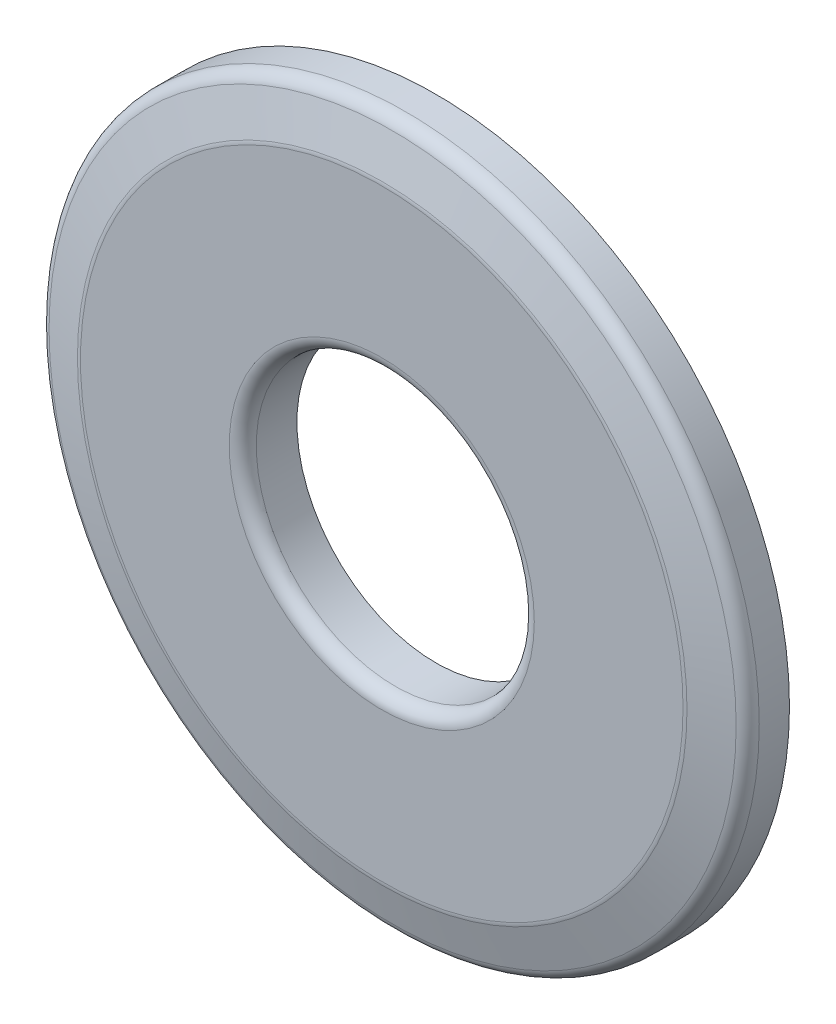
ISO-10303-21;
HEADER;
FILE_DESCRIPTION(('STEP AP214'),'2;1');
FILE_NAME('part.step','',(''),(''),'','','');
FILE_SCHEMA(('AUTOMOTIVE_DESIGN { 1 0 10303 214 1 1 1 1 }'));
ENDSEC;
DATA;
#1=APPLICATION_CONTEXT('core data for automotive mechanical design processes');
#2=APPLICATION_PROTOCOL_DEFINITION('international standard','automotive_design',2000,#1);
#3=PRODUCT_CONTEXT('',#1,'mechanical');
#4=PRODUCT('Part','Part','',(#3));
#5=PRODUCT_RELATED_PRODUCT_CATEGORY('part','',(#4));
#6=PRODUCT_DEFINITION_FORMATION('','',#4);
#7=PRODUCT_DEFINITION_CONTEXT('part definition',#1,'design');
#8=PRODUCT_DEFINITION('design','',#6,#7);
#9=PRODUCT_DEFINITION_SHAPE('','',#8);
#10=(LENGTH_UNIT() NAMED_UNIT(*) SI_UNIT(.MILLI.,.METRE.));
#11=(NAMED_UNIT(*) PLANE_ANGLE_UNIT() SI_UNIT($,.RADIAN.));
#12=(NAMED_UNIT(*) SI_UNIT($,.STERADIAN.) SOLID_ANGLE_UNIT());
#13=UNCERTAINTY_MEASURE_WITH_UNIT(LENGTH_MEASURE(1.E-05),#10,'distance_accuracy_value','');
#14=(GEOMETRIC_REPRESENTATION_CONTEXT(3) GLOBAL_UNCERTAINTY_ASSIGNED_CONTEXT((#13)) GLOBAL_UNIT_ASSIGNED_CONTEXT((#10,
#11,#12)) REPRESENTATION_CONTEXT('',''));
#15=CARTESIAN_POINT('',(0.,0.,0.));
#16=DIRECTION('',(0.,0.,1.));
#17=DIRECTION('',(1.,0.,0.));
#18=AXIS2_PLACEMENT_3D('',#15,#16,#17);
#19=CARTESIAN_POINT('',(0.,0.,1.7018));
#20=DIRECTION('',(0.,0.,1.));
#21=DIRECTION('',(1.,0.,0.));
#22=AXIS2_PLACEMENT_3D('',#19,#20,#21);
#23=PLANE('',#22);
#24=CARTESIAN_POINT('',(0.,0.,1.7018));
#25=DIRECTION('',(0.,0.,1.));
#26=DIRECTION('',(1.,0.,0.));
#27=AXIS2_PLACEMENT_3D('',#24,#25,#26);
#28=CIRCLE('',#27,18.9373748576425);
#29=CARTESIAN_POINT('',(18.9373748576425,0.,1.7018));
#30=VERTEX_POINT('',#29);
#31=EDGE_CURVE('E53',#30,#30,#28,.T.);
#32=ORIENTED_EDGE('',*,*,#31,.T.);
#33=EDGE_LOOP('',(#32));
#34=FACE_BOUND('',#33,.T.);
#35=CARTESIAN_POINT('',(0.,0.,1.7018));
#36=DIRECTION('',(0.,0.,1.));
#37=DIRECTION('',(1.,0.,0.));
#38=AXIS2_PLACEMENT_3D('',#35,#36,#37);
#39=CIRCLE('',#38,9.5885);
#40=CARTESIAN_POINT('',(9.5885,0.,1.7018));
#41=VERTEX_POINT('',#40);
#42=EDGE_CURVE('E56',#41,#41,#39,.F.);
#43=ORIENTED_EDGE('',*,*,#42,.T.);
#44=EDGE_LOOP('',(#43));
#45=FACE_BOUND('',#44,.T.);
#46=ADVANCED_FACE('F33',(#34,#45),#23,.T.);
#47=CARTESIAN_POINT('',(0.,0.,1.7018));
#48=DIRECTION('',(0.,0.,-1.));
#49=DIRECTION('',(-1.,0.,0.));
#50=AXIS2_PLACEMENT_3D('',#47,#48,#49);
#51=CYLINDRICAL_SURFACE('',#50,22.225);
#52=CARTESIAN_POINT('',(0.,0.,0.197981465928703));
#53=DIRECTION('',(0.,0.,1.));
#54=DIRECTION('',(1.,0.,0.));
#55=AXIS2_PLACEMENT_3D('',#52,#53,#54);
#56=CIRCLE('',#55,22.225);
#57=CARTESIAN_POINT('',(22.225,0.,0.197981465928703));
#58=VERTEX_POINT('',#57);
#59=EDGE_CURVE('E40',#58,#58,#56,.F.);
#60=ORIENTED_EDGE('',*,*,#59,.T.);
#61=EDGE_LOOP('',(#60));
#62=FACE_BOUND('',#61,.T.);
#63=CARTESIAN_POINT('',(0.,0.,-1.7018));
#64=DIRECTION('',(0.,0.,1.));
#65=DIRECTION('',(1.,0.,0.));
#66=AXIS2_PLACEMENT_3D('',#63,#64,#65);
#67=CIRCLE('',#66,22.225);
#68=CARTESIAN_POINT('',(22.225,0.,-1.7018));
#69=VERTEX_POINT('',#68);
#70=EDGE_CURVE('E59',#69,#69,#67,.T.);
#71=ORIENTED_EDGE('',*,*,#70,.T.);
#72=EDGE_LOOP('',(#71));
#73=FACE_BOUND('',#72,.T.);
#74=ADVANCED_FACE('F71',(#62,#73),#51,.T.);
#75=CARTESIAN_POINT('',(0.,0.,1.7018));
#76=DIRECTION('',(0.,0.,-1.));
#77=DIRECTION('',(-1.,0.,0.));
#78=AXIS2_PLACEMENT_3D('',#75,#76,#77);
#79=CYLINDRICAL_SURFACE('',#78,8.7376);
#80=CARTESIAN_POINT('',(0.,0.,0.850899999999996));
#81=DIRECTION('',(0.,0.,1.));
#82=DIRECTION('',(1.,0.,0.));
#83=AXIS2_PLACEMENT_3D('',#80,#81,#82);
#84=CIRCLE('',#83,8.7376);
#85=CARTESIAN_POINT('',(8.7376,0.,0.850899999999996));
#86=VERTEX_POINT('',#85);
#87=EDGE_CURVE('E10',#86,#86,#84,.T.);
#88=ORIENTED_EDGE('',*,*,#87,.T.);
#89=EDGE_LOOP('',(#88));
#90=FACE_BOUND('',#89,.T.);
#91=CARTESIAN_POINT('',(0.,0.,-1.7018));
#92=DIRECTION('',(0.,0.,1.));
#93=DIRECTION('',(1.,0.,0.));
#94=AXIS2_PLACEMENT_3D('',#91,#92,#93);
#95=CIRCLE('',#94,8.7376);
#96=CARTESIAN_POINT('',(8.7376,0.,-1.7018));
#97=VERTEX_POINT('',#96);
#98=EDGE_CURVE('E62',#97,#97,#95,.T.);
#99=ORIENTED_EDGE('',*,*,#98,.F.);
#100=EDGE_LOOP('',(#99));
#101=FACE_BOUND('',#100,.T.);
#102=ADVANCED_FACE('F69',(#90,#101),#79,.F.);
#103=CARTESIAN_POINT('',(0.,0.,-1.7018));
#104=DIRECTION('',(0.,0.,1.));
#105=DIRECTION('',(1.,0.,0.));
#106=AXIS2_PLACEMENT_3D('',#103,#104,#105);
#107=PLANE('',#106);
#108=ORIENTED_EDGE('',*,*,#98,.T.);
#109=EDGE_LOOP('',(#108));
#110=FACE_BOUND('',#109,.T.);
#111=ORIENTED_EDGE('',*,*,#70,.F.);
#112=EDGE_LOOP('',(#111));
#113=FACE_BOUND('',#112,.T.);
#114=ADVANCED_FACE('F66',(#110,#113),#107,.F.);
#115=CARTESIAN_POINT('',(0.,0.,1.7018));
#116=DIRECTION('',(0.,0.,-1.));
#117=DIRECTION('',(-1.,0.,0.));
#118=AXIS2_PLACEMENT_3D('',#115,#116,#117);
#119=CONICAL_SURFACE('',#118,19.0493979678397,1.30899693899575);
#120=CARTESIAN_POINT('',(0.,0.,1.67280628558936));
#121=DIRECTION('',(0.,0.,1.));
#122=DIRECTION('',(1.,0.,0.));
#123=AXIS2_PLACEMENT_3D('',#120,#121,#122);
#124=CIRCLE('',#123,19.1576039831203);
#125=CARTESIAN_POINT('',(19.1576039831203,0.,1.67280628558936));
#126=VERTEX_POINT('',#125);
#127=EDGE_CURVE('E44',#126,#126,#124,.F.);
#128=ORIENTED_EDGE('',*,*,#127,.T.);
#129=EDGE_LOOP('',(#128));
#130=FACE_BOUND('',#129,.T.);
#131=CARTESIAN_POINT('',(0.,0.,1.01988775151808));
#132=DIRECTION('',(0.,0.,-1.));
#133=DIRECTION('',(-1.,0.,0.));
#134=AXIS2_PLACEMENT_3D('',#131,#132,#133);
#135=CIRCLE('',#134,21.5943291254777);
#136=CARTESIAN_POINT('',(-21.5943291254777,0.,1.01988775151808));
#137=VERTEX_POINT('',#136);
#138=EDGE_CURVE('E48',#137,#137,#135,.F.);
#139=ORIENTED_EDGE('',*,*,#138,.T.);
#140=EDGE_LOOP('',(#139));
#141=FACE_BOUND('',#140,.T.);
#142=ADVANCED_FACE('F77',(#130,#141),#119,.T.);
#143=CARTESIAN_POINT('',(0.,0.,0.850899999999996));
#144=DIRECTION('',(0.,0.,1.));
#145=DIRECTION('',(1.,0.,0.));
#146=AXIS2_PLACEMENT_3D('',#143,#144,#145);
#147=TOROIDAL_SURFACE('',#146,18.9373748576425,0.8509);
#148=ORIENTED_EDGE('',*,*,#127,.F.);
#149=EDGE_LOOP('',(#148));
#150=FACE_BOUND('',#149,.T.);
#151=ORIENTED_EDGE('',*,*,#31,.F.);
#152=EDGE_LOOP('',(#151));
#153=FACE_BOUND('',#152,.T.);
#154=ADVANCED_FACE('F89',(#150,#153),#147,.T.);
#155=CARTESIAN_POINT('',(0.,0.,0.197981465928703));
#156=DIRECTION('',(0.,0.,1.));
#157=DIRECTION('',(1.,0.,0.));
#158=AXIS2_PLACEMENT_3D('',#155,#156,#157);
#159=TOROIDAL_SURFACE('',#158,21.3741,0.8509);
#160=ORIENTED_EDGE('',*,*,#138,.F.);
#161=EDGE_LOOP('',(#160));
#162=FACE_BOUND('',#161,.T.);
#163=ORIENTED_EDGE('',*,*,#59,.F.);
#164=EDGE_LOOP('',(#163));
#165=FACE_BOUND('',#164,.T.);
#166=ADVANCED_FACE('F92',(#162,#165),#159,.T.);
#167=CARTESIAN_POINT('',(0.,0.,0.850899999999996));
#168=DIRECTION('',(0.,0.,1.));
#169=DIRECTION('',(1.,0.,0.));
#170=AXIS2_PLACEMENT_3D('',#167,#168,#169);
#171=TOROIDAL_SURFACE('',#170,9.5885,0.8509);
#172=ORIENTED_EDGE('',*,*,#42,.F.);
#173=EDGE_LOOP('',(#172));
#174=FACE_BOUND('',#173,.T.);
#175=ORIENTED_EDGE('',*,*,#87,.F.);
#176=EDGE_LOOP('',(#175));
#177=FACE_BOUND('',#176,.T.);
#178=ADVANCED_FACE('F35',(#174,#177),#171,.T.);
#179=CLOSED_SHELL('',(#46,#74,#102,#114,#142,#154,#166,#178));
#180=MANIFOLD_SOLID_BREP('B2',#179);
#181=ADVANCED_BREP_SHAPE_REPRESENTATION('',(#18,#180),#14);
#182=SHAPE_DEFINITION_REPRESENTATION(#9,#181);
ENDSEC;
END-ISO-10303-21;
